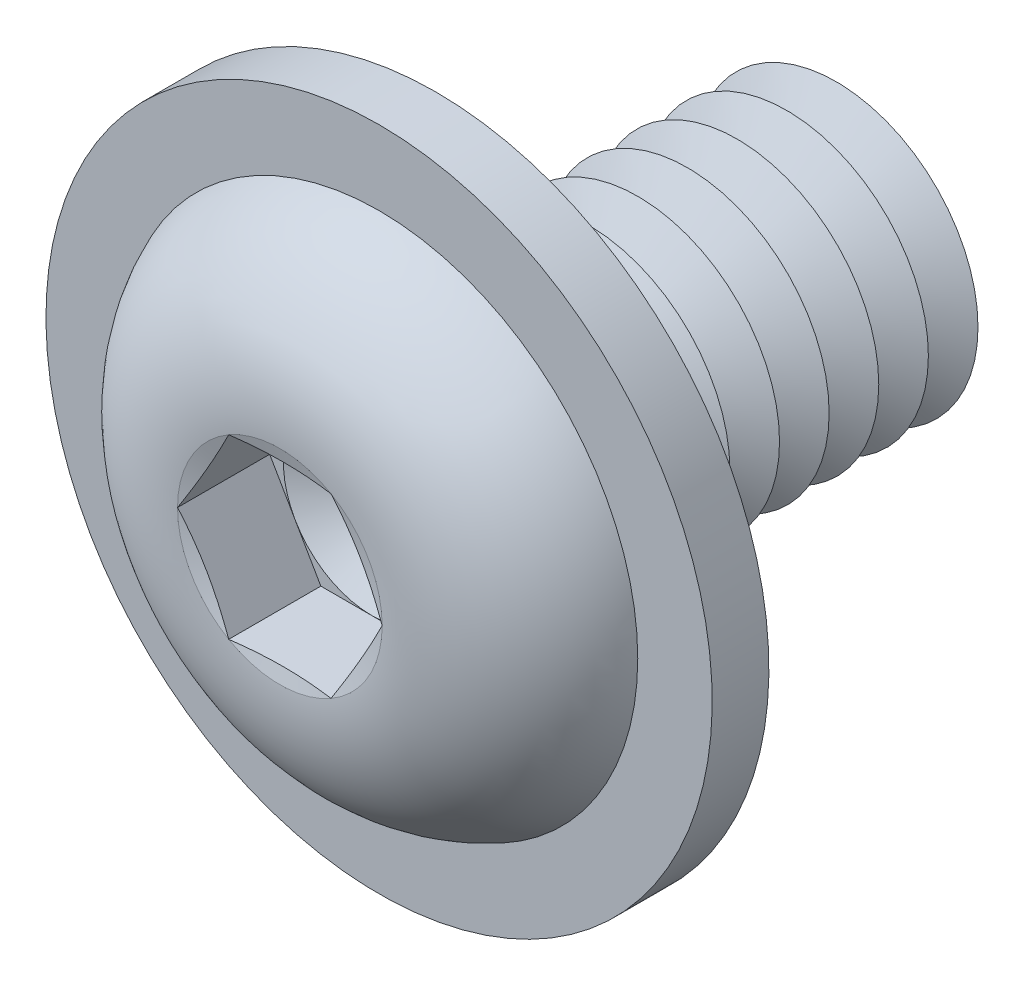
ISO-10303-21;
HEADER;
FILE_DESCRIPTION(('STEP AP214'),'2;1');
FILE_NAME('part.step','',(''),(''),'','','');
FILE_SCHEMA(('AUTOMOTIVE_DESIGN { 1 0 10303 214 1 1 1 1 }'));
ENDSEC;
DATA;
#1=APPLICATION_CONTEXT('core data for automotive mechanical design processes');
#2=APPLICATION_PROTOCOL_DEFINITION('international standard','automotive_design',2000,#1);
#3=PRODUCT_CONTEXT('',#1,'mechanical');
#4=PRODUCT('Part','Part','',(#3));
#5=PRODUCT_RELATED_PRODUCT_CATEGORY('part','',(#4));
#6=PRODUCT_DEFINITION_FORMATION('','',#4);
#7=PRODUCT_DEFINITION_CONTEXT('part definition',#1,'design');
#8=PRODUCT_DEFINITION('design','',#6,#7);
#9=PRODUCT_DEFINITION_SHAPE('','',#8);
#10=(LENGTH_UNIT() NAMED_UNIT(*) SI_UNIT(.MILLI.,.METRE.));
#11=(NAMED_UNIT(*) PLANE_ANGLE_UNIT() SI_UNIT($,.RADIAN.));
#12=(NAMED_UNIT(*) SI_UNIT($,.STERADIAN.) SOLID_ANGLE_UNIT());
#13=UNCERTAINTY_MEASURE_WITH_UNIT(LENGTH_MEASURE(1.E-05),#10,'distance_accuracy_value','');
#14=(GEOMETRIC_REPRESENTATION_CONTEXT(3) GLOBAL_UNCERTAINTY_ASSIGNED_CONTEXT((#13)) GLOBAL_UNIT_ASSIGNED_CONTEXT((#10,
#11,#12)) REPRESENTATION_CONTEXT('',''));
#15=CARTESIAN_POINT('',(0.,0.,0.));
#16=DIRECTION('',(0.,0.,1.));
#17=DIRECTION('',(1.,0.,0.));
#18=AXIS2_PLACEMENT_3D('',#15,#16,#17);
#19=CARTESIAN_POINT('',(0.,0.,-3.55));
#20=DIRECTION('',(0.,0.,1.));
#21=DIRECTION('',(1.,0.,0.));
#22=AXIS2_PLACEMENT_3D('',#19,#20,#21);
#23=CONICAL_SURFACE('',#22,2.,1.0471975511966);
#24=CARTESIAN_POINT('',(0.,0.,-3.9));
#25=DIRECTION('',(0.,0.,1.));
#26=DIRECTION('',(1.,0.,0.));
#27=AXIS2_PLACEMENT_3D('',#24,#25,#26);
#28=CIRCLE('',#27,1.39378221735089);
#29=CARTESIAN_POINT('',(1.39378221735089,0.,-3.9));
#30=VERTEX_POINT('',#29);
#31=EDGE_CURVE('E275',#30,#30,#28,.T.);
#32=ORIENTED_EDGE('',*,*,#31,.T.);
#33=EDGE_LOOP('',(#32));
#34=FACE_BOUND('',#33,.T.);
#35=CARTESIAN_POINT('',(0.,0.,-3.55));
#36=DIRECTION('',(0.,0.,1.));
#37=DIRECTION('',(1.,0.,0.));
#38=AXIS2_PLACEMENT_3D('',#35,#36,#37);
#39=CIRCLE('',#38,2.);
#40=CARTESIAN_POINT('',(2.,0.,-3.55));
#41=VERTEX_POINT('',#40);
#42=EDGE_CURVE('E271',#41,#41,#39,.T.);
#43=ORIENTED_EDGE('',*,*,#42,.F.);
#44=EDGE_LOOP('',(#43));
#45=FACE_BOUND('',#44,.T.);
#46=ADVANCED_FACE('F39',(#34,#45),#23,.T.);
#47=CARTESIAN_POINT('',(0.,0.,-3.9));
#48=DIRECTION('',(0.,0.,-1.));
#49=DIRECTION('',(-1.,0.,0.));
#50=AXIS2_PLACEMENT_3D('',#47,#48,#49);
#51=CONICAL_SURFACE('',#50,1.39378221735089,1.0471975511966);
#52=CARTESIAN_POINT('',(0.,0.,-4.25));
#53=DIRECTION('',(0.,0.,1.));
#54=DIRECTION('',(1.,0.,0.));
#55=AXIS2_PLACEMENT_3D('',#52,#53,#54);
#56=CIRCLE('',#55,2.);
#57=CARTESIAN_POINT('',(2.,0.,-4.25));
#58=VERTEX_POINT('',#57);
#59=EDGE_CURVE('E279',#58,#58,#56,.T.);
#60=ORIENTED_EDGE('',*,*,#59,.T.);
#61=EDGE_LOOP('',(#60));
#62=FACE_BOUND('',#61,.T.);
#63=ORIENTED_EDGE('',*,*,#31,.F.);
#64=EDGE_LOOP('',(#63));
#65=FACE_BOUND('',#64,.T.);
#66=ADVANCED_FACE('F422',(#62,#65),#51,.T.);
#67=CARTESIAN_POINT('',(0.,2.,-6.));
#68=DIRECTION('',(0.,0.,-1.));
#69=DIRECTION('',(-1.,0.,0.));
#70=AXIS2_PLACEMENT_3D('',#67,#68,#69);
#71=PLANE('',#70);
#72=CARTESIAN_POINT('',(0.,0.,-6.));
#73=DIRECTION('',(0.,0.,1.));
#74=DIRECTION('',(1.,0.,0.));
#75=AXIS2_PLACEMENT_3D('',#72,#73,#74);
#76=CIRCLE('',#75,1.39378221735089);
#77=CARTESIAN_POINT('',(1.39378221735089,0.,-6.));
#78=VERTEX_POINT('',#77);
#79=EDGE_CURVE('E298',#78,#78,#76,.T.);
#80=ORIENTED_EDGE('',*,*,#79,.F.);
#81=EDGE_LOOP('',(#80));
#82=FACE_BOUND('',#81,.T.);
#83=ADVANCED_FACE('F428',(#82),#71,.T.);
#84=CARTESIAN_POINT('',(0.,0.,-5.65));
#85=DIRECTION('',(0.,0.,1.));
#86=DIRECTION('',(1.,0.,0.));
#87=AXIS2_PLACEMENT_3D('',#84,#85,#86);
#88=CONICAL_SURFACE('',#87,2.,1.0471975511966);
#89=ORIENTED_EDGE('',*,*,#79,.T.);
#90=EDGE_LOOP('',(#89));
#91=FACE_BOUND('',#90,.T.);
#92=CARTESIAN_POINT('',(0.,0.,-5.65));
#93=DIRECTION('',(0.,0.,1.));
#94=DIRECTION('',(1.,0.,0.));
#95=AXIS2_PLACEMENT_3D('',#92,#93,#94);
#96=CIRCLE('',#95,2.);
#97=CARTESIAN_POINT('',(2.,0.,-5.65));
#98=VERTEX_POINT('',#97);
#99=EDGE_CURVE('E294',#98,#98,#96,.T.);
#100=ORIENTED_EDGE('',*,*,#99,.F.);
#101=EDGE_LOOP('',(#100));
#102=FACE_BOUND('',#101,.T.);
#103=ADVANCED_FACE('F447',(#91,#102),#88,.T.);
#104=CARTESIAN_POINT('',(0.,0.,-5.3));
#105=DIRECTION('',(0.,0.,-1.));
#106=DIRECTION('',(-1.,0.,0.));
#107=AXIS2_PLACEMENT_3D('',#104,#105,#106);
#108=CONICAL_SURFACE('',#107,1.39378221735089,1.0471975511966);
#109=ORIENTED_EDGE('',*,*,#99,.T.);
#110=EDGE_LOOP('',(#109));
#111=FACE_BOUND('',#110,.T.);
#112=CARTESIAN_POINT('',(0.,0.,-5.3));
#113=DIRECTION('',(0.,0.,1.));
#114=DIRECTION('',(1.,0.,0.));
#115=AXIS2_PLACEMENT_3D('',#112,#113,#114);
#116=CIRCLE('',#115,1.39378221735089);
#117=CARTESIAN_POINT('',(1.39378221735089,0.,-5.3));
#118=VERTEX_POINT('',#117);
#119=EDGE_CURVE('E291',#118,#118,#116,.T.);
#120=ORIENTED_EDGE('',*,*,#119,.F.);
#121=EDGE_LOOP('',(#120));
#122=FACE_BOUND('',#121,.T.);
#123=ADVANCED_FACE('F444',(#111,#122),#108,.T.);
#124=CARTESIAN_POINT('',(0.,0.,-4.95));
#125=DIRECTION('',(0.,0.,1.));
#126=DIRECTION('',(1.,0.,0.));
#127=AXIS2_PLACEMENT_3D('',#124,#125,#126);
#128=CONICAL_SURFACE('',#127,2.,1.0471975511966);
#129=ORIENTED_EDGE('',*,*,#119,.T.);
#130=EDGE_LOOP('',(#129));
#131=FACE_BOUND('',#130,.T.);
#132=CARTESIAN_POINT('',(0.,0.,-4.95));
#133=DIRECTION('',(0.,0.,1.));
#134=DIRECTION('',(1.,0.,0.));
#135=AXIS2_PLACEMENT_3D('',#132,#133,#134);
#136=CIRCLE('',#135,2.);
#137=CARTESIAN_POINT('',(2.,0.,-4.95));
#138=VERTEX_POINT('',#137);
#139=EDGE_CURVE('E287',#138,#138,#136,.T.);
#140=ORIENTED_EDGE('',*,*,#139,.F.);
#141=EDGE_LOOP('',(#140));
#142=FACE_BOUND('',#141,.T.);
#143=ADVANCED_FACE('F438',(#131,#142),#128,.T.);
#144=CARTESIAN_POINT('',(0.,0.,-4.6));
#145=DIRECTION('',(0.,0.,-1.));
#146=DIRECTION('',(-1.,0.,0.));
#147=AXIS2_PLACEMENT_3D('',#144,#145,#146);
#148=CONICAL_SURFACE('',#147,1.39378221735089,1.0471975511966);
#149=ORIENTED_EDGE('',*,*,#139,.T.);
#150=EDGE_LOOP('',(#149));
#151=FACE_BOUND('',#150,.T.);
#152=CARTESIAN_POINT('',(0.,0.,-4.6));
#153=DIRECTION('',(0.,0.,1.));
#154=DIRECTION('',(1.,0.,0.));
#155=AXIS2_PLACEMENT_3D('',#152,#153,#154);
#156=CIRCLE('',#155,1.39378221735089);
#157=CARTESIAN_POINT('',(1.39378221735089,0.,-4.6));
#158=VERTEX_POINT('',#157);
#159=EDGE_CURVE('E283',#158,#158,#156,.T.);
#160=ORIENTED_EDGE('',*,*,#159,.F.);
#161=EDGE_LOOP('',(#160));
#162=FACE_BOUND('',#161,.T.);
#163=ADVANCED_FACE('F434',(#151,#162),#148,.T.);
#164=CARTESIAN_POINT('',(0.,0.,-4.25));
#165=DIRECTION('',(0.,0.,1.));
#166=DIRECTION('',(1.,0.,0.));
#167=AXIS2_PLACEMENT_3D('',#164,#165,#166);
#168=CONICAL_SURFACE('',#167,2.,1.0471975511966);
#169=ORIENTED_EDGE('',*,*,#159,.T.);
#170=EDGE_LOOP('',(#169));
#171=FACE_BOUND('',#170,.T.);
#172=ORIENTED_EDGE('',*,*,#59,.F.);
#173=EDGE_LOOP('',(#172));
#174=FACE_BOUND('',#173,.T.);
#175=ADVANCED_FACE('F437',(#171,#174),#168,.T.);
#176=CARTESIAN_POINT('',(0.,0.,-2.85));
#177=DIRECTION('',(0.,0.,1.));
#178=DIRECTION('',(1.,0.,0.));
#179=AXIS2_PLACEMENT_3D('',#176,#177,#178);
#180=CONICAL_SURFACE('',#179,2.,1.0471975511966);
#181=CARTESIAN_POINT('',(0.,0.,-3.2));
#182=DIRECTION('',(0.,0.,1.));
#183=DIRECTION('',(1.,0.,0.));
#184=AXIS2_PLACEMENT_3D('',#181,#182,#183);
#185=CIRCLE('',#184,1.39378221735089);
#186=CARTESIAN_POINT('',(1.39378221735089,0.,-3.2));
#187=VERTEX_POINT('',#186);
#188=EDGE_CURVE('E267',#187,#187,#185,.T.);
#189=ORIENTED_EDGE('',*,*,#188,.T.);
#190=EDGE_LOOP('',(#189));
#191=FACE_BOUND('',#190,.T.);
#192=CARTESIAN_POINT('',(0.,0.,-2.85));
#193=DIRECTION('',(0.,0.,1.));
#194=DIRECTION('',(1.,0.,0.));
#195=AXIS2_PLACEMENT_3D('',#192,#193,#194);
#196=CIRCLE('',#195,2.);
#197=CARTESIAN_POINT('',(2.,0.,-2.85));
#198=VERTEX_POINT('',#197);
#199=EDGE_CURVE('E263',#198,#198,#196,.T.);
#200=ORIENTED_EDGE('',*,*,#199,.F.);
#201=EDGE_LOOP('',(#200));
#202=FACE_BOUND('',#201,.T.);
#203=ADVANCED_FACE('F442',(#191,#202),#180,.T.);
#204=CARTESIAN_POINT('',(0.,0.,-3.2));
#205=DIRECTION('',(0.,0.,-1.));
#206=DIRECTION('',(-1.,0.,0.));
#207=AXIS2_PLACEMENT_3D('',#204,#205,#206);
#208=CONICAL_SURFACE('',#207,1.39378221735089,1.0471975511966);
#209=ORIENTED_EDGE('',*,*,#42,.T.);
#210=EDGE_LOOP('',(#209));
#211=FACE_BOUND('',#210,.T.);
#212=ORIENTED_EDGE('',*,*,#188,.F.);
#213=EDGE_LOOP('',(#212));
#214=FACE_BOUND('',#213,.T.);
#215=ADVANCED_FACE('F493',(#211,#214),#208,.T.);
#216=CARTESIAN_POINT('',(0.,0.,-2.15));
#217=DIRECTION('',(0.,0.,1.));
#218=DIRECTION('',(1.,0.,0.));
#219=AXIS2_PLACEMENT_3D('',#216,#217,#218);
#220=CONICAL_SURFACE('',#219,2.,1.0471975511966);
#221=CARTESIAN_POINT('',(0.,0.,-2.5));
#222=DIRECTION('',(0.,0.,1.));
#223=DIRECTION('',(1.,0.,0.));
#224=AXIS2_PLACEMENT_3D('',#221,#222,#223);
#225=CIRCLE('',#224,1.39378221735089);
#226=CARTESIAN_POINT('',(1.39378221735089,0.,-2.5));
#227=VERTEX_POINT('',#226);
#228=EDGE_CURVE('E259',#227,#227,#225,.T.);
#229=ORIENTED_EDGE('',*,*,#228,.T.);
#230=EDGE_LOOP('',(#229));
#231=FACE_BOUND('',#230,.T.);
#232=CARTESIAN_POINT('',(0.,0.,-2.15));
#233=DIRECTION('',(0.,0.,1.));
#234=DIRECTION('',(1.,0.,0.));
#235=AXIS2_PLACEMENT_3D('',#232,#233,#234);
#236=CIRCLE('',#235,2.);
#237=CARTESIAN_POINT('',(2.,0.,-2.15));
#238=VERTEX_POINT('',#237);
#239=EDGE_CURVE('E255',#238,#238,#236,.T.);
#240=ORIENTED_EDGE('',*,*,#239,.F.);
#241=EDGE_LOOP('',(#240));
#242=FACE_BOUND('',#241,.T.);
#243=ADVANCED_FACE('F499',(#231,#242),#220,.T.);
#244=CARTESIAN_POINT('',(0.,0.,-2.5));
#245=DIRECTION('',(0.,0.,-1.));
#246=DIRECTION('',(-1.,0.,0.));
#247=AXIS2_PLACEMENT_3D('',#244,#245,#246);
#248=CONICAL_SURFACE('',#247,1.39378221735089,1.0471975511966);
#249=ORIENTED_EDGE('',*,*,#199,.T.);
#250=EDGE_LOOP('',(#249));
#251=FACE_BOUND('',#250,.T.);
#252=ORIENTED_EDGE('',*,*,#228,.F.);
#253=EDGE_LOOP('',(#252));
#254=FACE_BOUND('',#253,.T.);
#255=ADVANCED_FACE('F506',(#251,#254),#248,.T.);
#256=CARTESIAN_POINT('',(0.,0.,-1.45));
#257=DIRECTION('',(0.,0.,1.));
#258=DIRECTION('',(1.,0.,0.));
#259=AXIS2_PLACEMENT_3D('',#256,#257,#258);
#260=CONICAL_SURFACE('',#259,2.,1.0471975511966);
#261=CARTESIAN_POINT('',(0.,0.,-1.8));
#262=DIRECTION('',(0.,0.,1.));
#263=DIRECTION('',(1.,0.,0.));
#264=AXIS2_PLACEMENT_3D('',#261,#262,#263);
#265=CIRCLE('',#264,1.39378221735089);
#266=CARTESIAN_POINT('',(1.39378221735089,0.,-1.8));
#267=VERTEX_POINT('',#266);
#268=EDGE_CURVE('E251',#267,#267,#265,.T.);
#269=ORIENTED_EDGE('',*,*,#268,.T.);
#270=EDGE_LOOP('',(#269));
#271=FACE_BOUND('',#270,.T.);
#272=CARTESIAN_POINT('',(0.,0.,-1.45));
#273=DIRECTION('',(0.,0.,1.));
#274=DIRECTION('',(1.,0.,0.));
#275=AXIS2_PLACEMENT_3D('',#272,#273,#274);
#276=CIRCLE('',#275,2.);
#277=CARTESIAN_POINT('',(2.,0.,-1.45));
#278=VERTEX_POINT('',#277);
#279=EDGE_CURVE('E243',#278,#278,#276,.T.);
#280=ORIENTED_EDGE('',*,*,#279,.F.);
#281=EDGE_LOOP('',(#280));
#282=FACE_BOUND('',#281,.T.);
#283=ADVANCED_FACE('F513',(#271,#282),#260,.T.);
#284=CARTESIAN_POINT('',(0.,0.,-1.8));
#285=DIRECTION('',(0.,0.,-1.));
#286=DIRECTION('',(-1.,0.,0.));
#287=AXIS2_PLACEMENT_3D('',#284,#285,#286);
#288=CONICAL_SURFACE('',#287,1.39378221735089,1.0471975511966);
#289=ORIENTED_EDGE('',*,*,#239,.T.);
#290=EDGE_LOOP('',(#289));
#291=FACE_BOUND('',#290,.T.);
#292=ORIENTED_EDGE('',*,*,#268,.F.);
#293=EDGE_LOOP('',(#292));
#294=FACE_BOUND('',#293,.T.);
#295=ADVANCED_FACE('F520',(#291,#294),#288,.T.);
#296=CARTESIAN_POINT('',(0.,0.,-0.750000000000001));
#297=DIRECTION('',(0.,0.,1.));
#298=DIRECTION('',(1.,0.,0.));
#299=AXIS2_PLACEMENT_3D('',#296,#297,#298);
#300=CONICAL_SURFACE('',#299,2.,1.0471975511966);
#301=CARTESIAN_POINT('',(0.,0.,-1.1));
#302=DIRECTION('',(0.,0.,1.));
#303=DIRECTION('',(1.,0.,0.));
#304=AXIS2_PLACEMENT_3D('',#301,#302,#303);
#305=CIRCLE('',#304,1.39378221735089);
#306=CARTESIAN_POINT('',(1.39378221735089,0.,-1.1));
#307=VERTEX_POINT('',#306);
#308=EDGE_CURVE('E232',#307,#307,#305,.T.);
#309=ORIENTED_EDGE('',*,*,#308,.T.);
#310=EDGE_LOOP('',(#309));
#311=FACE_BOUND('',#310,.T.);
#312=CARTESIAN_POINT('',(0.,0.,-0.750000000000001));
#313=DIRECTION('',(0.,0.,1.));
#314=DIRECTION('',(1.,0.,0.));
#315=AXIS2_PLACEMENT_3D('',#312,#313,#314);
#316=CIRCLE('',#315,2.);
#317=CARTESIAN_POINT('',(2.,0.,-0.750000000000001));
#318=VERTEX_POINT('',#317);
#319=EDGE_CURVE('E247',#318,#318,#316,.T.);
#320=ORIENTED_EDGE('',*,*,#319,.F.);
#321=EDGE_LOOP('',(#320));
#322=FACE_BOUND('',#321,.T.);
#323=ADVANCED_FACE('F527',(#311,#322),#300,.T.);
#324=CARTESIAN_POINT('',(0.,0.,-1.1));
#325=DIRECTION('',(0.,0.,-1.));
#326=DIRECTION('',(-1.,0.,0.));
#327=AXIS2_PLACEMENT_3D('',#324,#325,#326);
#328=CONICAL_SURFACE('',#327,1.39378221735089,1.0471975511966);
#329=ORIENTED_EDGE('',*,*,#279,.T.);
#330=EDGE_LOOP('',(#329));
#331=FACE_BOUND('',#330,.T.);
#332=ORIENTED_EDGE('',*,*,#308,.F.);
#333=EDGE_LOOP('',(#332));
#334=FACE_BOUND('',#333,.T.);
#335=ADVANCED_FACE('F221',(#331,#334),#328,.T.);
#336=CARTESIAN_POINT('',(0.,2.,0.));
#337=DIRECTION('',(0.,0.,-1.));
#338=DIRECTION('',(-1.,0.,0.));
#339=AXIS2_PLACEMENT_3D('',#336,#337,#338);
#340=PLANE('',#339);
#341=CARTESIAN_POINT('',(0.,0.,0.));
#342=DIRECTION('',(0.,0.,-1.));
#343=DIRECTION('',(-1.,0.,0.));
#344=AXIS2_PLACEMENT_3D('',#341,#342,#343);
#345=CIRCLE('',#344,2.35);
#346=CARTESIAN_POINT('',(-2.35,0.,0.));
#347=VERTEX_POINT('',#346);
#348=EDGE_CURVE('E312',#347,#347,#345,.F.);
#349=ORIENTED_EDGE('',*,*,#348,.T.);
#350=EDGE_LOOP('',(#349));
#351=FACE_BOUND('',#350,.T.);
#352=CARTESIAN_POINT('',(0.,0.,0.));
#353=DIRECTION('',(0.,0.,-1.));
#354=DIRECTION('',(0.,1.,0.));
#355=AXIS2_PLACEMENT_3D('',#352,#353,#354);
#356=CIRCLE('',#355,4.7);
#357=CARTESIAN_POINT('',(0.,4.7,0.));
#358=VERTEX_POINT('',#357);
#359=EDGE_CURVE('E376',#358,#358,#356,.T.);
#360=ORIENTED_EDGE('',*,*,#359,.T.);
#361=EDGE_LOOP('',(#360));
#362=FACE_BOUND('',#361,.T.);
#363=ADVANCED_FACE('F539',(#351,#362),#340,.T.);
#364=CARTESIAN_POINT('',(0.,0.,-0.35));
#365=DIRECTION('',(0.,0.,-1.));
#366=DIRECTION('',(-1.,0.,0.));
#367=AXIS2_PLACEMENT_3D('',#364,#365,#366);
#368=TOROIDAL_SURFACE('',#367,2.35,0.35);
#369=ORIENTED_EDGE('',*,*,#348,.F.);
#370=EDGE_LOOP('',(#369));
#371=FACE_BOUND('',#370,.T.);
#372=CARTESIAN_POINT('',(0.,0.,-0.35));
#373=DIRECTION('',(0.,0.,-1.));
#374=DIRECTION('',(-1.,0.,0.));
#375=AXIS2_PLACEMENT_3D('',#372,#373,#374);
#376=CIRCLE('',#375,2.);
#377=CARTESIAN_POINT('',(-2.,0.,-0.35));
#378=VERTEX_POINT('',#377);
#379=EDGE_CURVE('E307',#378,#378,#376,.T.);
#380=ORIENTED_EDGE('',*,*,#379,.F.);
#381=EDGE_LOOP('',(#380));
#382=FACE_BOUND('',#381,.T.);
#383=ADVANCED_FACE('F41',(#371,#382),#368,.F.);
#384=CARTESIAN_POINT('',(0.,0.,-6.));
#385=DIRECTION('',(0.,0.,-1.));
#386=DIRECTION('',(-1.,0.,0.));
#387=AXIS2_PLACEMENT_3D('',#384,#385,#386);
#388=CYLINDRICAL_SURFACE('',#387,2.);
#389=ORIENTED_EDGE('',*,*,#379,.T.);
#390=EDGE_LOOP('',(#389));
#391=FACE_BOUND('',#390,.T.);
#392=ORIENTED_EDGE('',*,*,#319,.T.);
#393=EDGE_LOOP('',(#392));
#394=FACE_BOUND('',#393,.T.);
#395=ADVANCED_FACE('F551',(#391,#394),#388,.T.);
#396=CARTESIAN_POINT('',(0.,0.,0.8));
#397=DIRECTION('',(0.,0.,-1.));
#398=DIRECTION('',(0.,1.,0.));
#399=AXIS2_PLACEMENT_3D('',#396,#397,#398);
#400=CYLINDRICAL_SURFACE('',#399,4.7);
#401=CARTESIAN_POINT('',(0.,0.,0.8));
#402=DIRECTION('',(0.,0.,-1.));
#403=DIRECTION('',(0.,1.,0.));
#404=AXIS2_PLACEMENT_3D('',#401,#402,#403);
#405=CIRCLE('',#404,4.7);
#406=CARTESIAN_POINT('',(0.,4.7,0.8));
#407=VERTEX_POINT('',#406);
#408=EDGE_CURVE('E374',#407,#407,#405,.T.);
#409=ORIENTED_EDGE('',*,*,#408,.T.);
#410=EDGE_LOOP('',(#409));
#411=FACE_BOUND('',#410,.T.);
#412=ORIENTED_EDGE('',*,*,#359,.F.);
#413=EDGE_LOOP('',(#412));
#414=FACE_BOUND('',#413,.T.);
#415=ADVANCED_FACE('F557',(#411,#414),#400,.T.);
#416=CARTESIAN_POINT('',(0.,0.,0.8));
#417=DIRECTION('',(0.,0.,-1.));
#418=DIRECTION('',(0.,1.,0.));
#419=AXIS2_PLACEMENT_3D('',#416,#417,#418);
#420=PLANE('',#419);
#421=CARTESIAN_POINT('',(0.,0.,0.8));
#422=DIRECTION('',(0.,0.,-1.));
#423=DIRECTION('',(0.,1.,0.));
#424=AXIS2_PLACEMENT_3D('',#421,#422,#423);
#425=CIRCLE('',#424,3.64977164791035);
#426=CARTESIAN_POINT('',(0.,3.64977164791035,0.8));
#427=VERTEX_POINT('',#426);
#428=EDGE_CURVE('E43',#427,#427,#425,.F.);
#429=ORIENTED_EDGE('',*,*,#428,.F.);
#430=EDGE_LOOP('',(#429));
#431=FACE_BOUND('',#430,.T.);
#432=ORIENTED_EDGE('',*,*,#408,.F.);
#433=EDGE_LOOP('',(#432));
#434=FACE_BOUND('',#433,.T.);
#435=ADVANCED_FACE('F117',(#431,#434),#420,.F.);
#436=CARTESIAN_POINT('',(0.,0.,0.9));
#437=DIRECTION('',(0.,0.,1.));
#438=DIRECTION('',(1.,0.,0.));
#439=AXIS2_PLACEMENT_3D('',#436,#437,#438);
#440=CONICAL_SURFACE('',#439,1.24999941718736,1.0471975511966);
#441=CARTESIAN_POINT('',(0.,0.,0.178312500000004));
#442=VERTEX_POINT('',#441);
#443=VERTEX_LOOP('',#442);
#444=FACE_BOUND('',#443,.T.);
#445=CARTESIAN_POINT('',(0.,0.,0.9));
#446=DIRECTION('',(0.,0.,1.));
#447=DIRECTION('',(1.,0.,0.));
#448=AXIS2_PLACEMENT_3D('',#445,#446,#447);
#449=CIRCLE('',#448,1.24999941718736);
#450=CARTESIAN_POINT('',(1.08253125,0.624999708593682,0.9));
#451=VERTEX_POINT('',#450);
#452=CARTESIAN_POINT('',(0.,1.24999941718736,0.9));
#453=VERTEX_POINT('',#452);
#454=EDGE_CURVE('E120',#451,#453,#449,.T.);
#455=ORIENTED_EDGE('',*,*,#454,.T.);
#456=CARTESIAN_POINT('',(0.,0.,0.9));
#457=DIRECTION('',(0.,0.,1.));
#458=DIRECTION('',(1.,0.,0.));
#459=AXIS2_PLACEMENT_3D('',#456,#457,#458);
#460=CIRCLE('',#459,1.24999941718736);
#461=CARTESIAN_POINT('',(-1.08253125,0.624999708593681,0.9));
#462=VERTEX_POINT('',#461);
#463=EDGE_CURVE('E11',#453,#462,#460,.T.);
#464=ORIENTED_EDGE('',*,*,#463,.T.);
#465=CARTESIAN_POINT('',(-1.08253125,-0.624999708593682,0.9));
#466=VERTEX_POINT('',#465);
#467=EDGE_CURVE('E49',#462,#466,#460,.T.);
#468=ORIENTED_EDGE('',*,*,#467,.T.);
#469=CARTESIAN_POINT('',(0.,-1.24999941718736,0.9));
#470=VERTEX_POINT('',#469);
#471=EDGE_CURVE('E319',#466,#470,#460,.T.);
#472=ORIENTED_EDGE('',*,*,#471,.T.);
#473=CARTESIAN_POINT('',(1.08253125,-0.624999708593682,0.9));
#474=VERTEX_POINT('',#473);
#475=EDGE_CURVE('E57',#470,#474,#460,.T.);
#476=ORIENTED_EDGE('',*,*,#475,.T.);
#477=EDGE_CURVE('E50',#474,#451,#460,.T.);
#478=ORIENTED_EDGE('',*,*,#477,.T.);
#479=EDGE_LOOP('',(#455,#464,#468,#472,#476,#478));
#480=FACE_BOUND('',#479,.T.);
#481=ADVANCED_FACE('F114',(#444,#480),#440,.F.);
#482=CARTESIAN_POINT('',(0.,0.,0.9));
#483=DIRECTION('',(0.,0.,1.));
#484=DIRECTION('',(1.,0.,0.));
#485=AXIS2_PLACEMENT_3D('',#482,#483,#484);
#486=PLANE('',#485);
#487=ORIENTED_EDGE('',*,*,#471,.F.);
#488=DIRECTION('',(0.5,-0.866025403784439,0.));
#489=VECTOR('',#488,1.);
#490=CARTESIAN_POINT('',(-1.443375,0.,0.9));
#491=LINE('',#490,#489);
#492=CARTESIAN_POINT('',(-0.7216875,-1.24999941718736,0.9));
#493=VERTEX_POINT('',#492);
#494=EDGE_CURVE('E154',#466,#493,#491,.T.);
#495=ORIENTED_EDGE('',*,*,#494,.T.);
#496=DIRECTION('',(1.,0.,0.));
#497=VECTOR('',#496,1.);
#498=CARTESIAN_POINT('',(-0.7216875,-1.24999941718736,0.9));
#499=LINE('',#498,#497);
#500=EDGE_CURVE('E160',#493,#470,#499,.T.);
#501=ORIENTED_EDGE('',*,*,#500,.T.);
#502=EDGE_LOOP('',(#487,#495,#501));
#503=FACE_BOUND('',#502,.T.);
#504=ADVANCED_FACE('F116',(#503),#486,.T.);
#505=ORIENTED_EDGE('',*,*,#475,.F.);
#506=CARTESIAN_POINT('',(0.721687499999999,-1.24999941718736,0.9));
#507=VERTEX_POINT('',#506);
#508=EDGE_CURVE('E159',#470,#507,#499,.T.);
#509=ORIENTED_EDGE('',*,*,#508,.T.);
#510=DIRECTION('',(0.5,0.866025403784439,0.));
#511=VECTOR('',#510,1.);
#512=CARTESIAN_POINT('',(0.721687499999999,-1.24999941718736,0.9));
#513=LINE('',#512,#511);
#514=EDGE_CURVE('E165',#507,#474,#513,.T.);
#515=ORIENTED_EDGE('',*,*,#514,.T.);
#516=EDGE_LOOP('',(#505,#509,#515));
#517=FACE_BOUND('',#516,.T.);
#518=ADVANCED_FACE('F382',(#517),#486,.T.);
#519=ORIENTED_EDGE('',*,*,#477,.F.);
#520=CARTESIAN_POINT('',(1.443375,0.,0.9));
#521=VERTEX_POINT('',#520);
#522=EDGE_CURVE('E164',#474,#521,#513,.T.);
#523=ORIENTED_EDGE('',*,*,#522,.T.);
#524=DIRECTION('',(-0.5,0.866025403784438,0.));
#525=VECTOR('',#524,1.);
#526=CARTESIAN_POINT('',(1.443375,0.,0.9));
#527=LINE('',#526,#525);
#528=EDGE_CURVE('E142',#521,#451,#527,.T.);
#529=ORIENTED_EDGE('',*,*,#528,.T.);
#530=EDGE_LOOP('',(#519,#523,#529));
#531=FACE_BOUND('',#530,.T.);
#532=ADVANCED_FACE('F395',(#531),#486,.T.);
#533=ORIENTED_EDGE('',*,*,#454,.F.);
#534=CARTESIAN_POINT('',(0.7216875,1.24999941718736,0.9));
#535=VERTEX_POINT('',#534);
#536=EDGE_CURVE('E127',#451,#535,#527,.T.);
#537=ORIENTED_EDGE('',*,*,#536,.T.);
#538=DIRECTION('',(-1.,0.,0.));
#539=VECTOR('',#538,1.);
#540=CARTESIAN_POINT('',(0.7216875,1.24999941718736,0.9));
#541=LINE('',#540,#539);
#542=EDGE_CURVE('E138',#535,#453,#541,.T.);
#543=ORIENTED_EDGE('',*,*,#542,.T.);
#544=EDGE_LOOP('',(#533,#537,#543));
#545=FACE_BOUND('',#544,.T.);
#546=ADVANCED_FACE('F144',(#545),#486,.T.);
#547=ORIENTED_EDGE('',*,*,#463,.F.);
#548=CARTESIAN_POINT('',(-0.721687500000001,1.24999941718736,0.9));
#549=VERTEX_POINT('',#548);
#550=EDGE_CURVE('E133',#453,#549,#541,.T.);
#551=ORIENTED_EDGE('',*,*,#550,.T.);
#552=DIRECTION('',(-0.5,-0.866025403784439,0.));
#553=VECTOR('',#552,1.);
#554=CARTESIAN_POINT('',(-0.721687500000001,1.24999941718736,0.9));
#555=LINE('',#554,#553);
#556=EDGE_CURVE('E136',#549,#462,#555,.T.);
#557=ORIENTED_EDGE('',*,*,#556,.T.);
#558=EDGE_LOOP('',(#547,#551,#557));
#559=FACE_BOUND('',#558,.T.);
#560=ADVANCED_FACE('F132',(#559),#486,.T.);
#561=ORIENTED_EDGE('',*,*,#467,.F.);
#562=CARTESIAN_POINT('',(-1.443375,0.,0.9));
#563=VERTEX_POINT('',#562);
#564=EDGE_CURVE('E146',#462,#563,#555,.T.);
#565=ORIENTED_EDGE('',*,*,#564,.T.);
#566=EDGE_CURVE('E155',#563,#466,#491,.T.);
#567=ORIENTED_EDGE('',*,*,#566,.T.);
#568=EDGE_LOOP('',(#561,#565,#567));
#569=FACE_BOUND('',#568,.T.);
#570=ADVANCED_FACE('F335',(#569),#486,.T.);
#571=CARTESIAN_POINT('',(-1.443375,0.,0.9));
#572=DIRECTION('',(-0.866025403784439,-0.5,0.));
#573=DIRECTION('',(0.5,-0.866025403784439,0.));
#574=AXIS2_PLACEMENT_3D('',#571,#572,#573);
#575=PLANE('',#574);
#576=CARTESIAN_POINT('',(-1.44349047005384,0.000200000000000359,2.20003094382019));
#577=CARTESIAN_POINT('',(-1.41351104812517,-0.0517258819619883,2.19199301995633));
#578=CARTESIAN_POINT('',(-1.38347725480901,-0.10374593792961,2.18469579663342));
#579=CARTESIAN_POINT('',(-1.32330355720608,-0.20796983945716,2.17187512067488));
#580=CARTESIAN_POINT('',(-1.29316361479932,-0.260173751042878,2.16635238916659));
#581=CARTESIAN_POINT('',(-1.23296043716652,-0.364448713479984,2.15740323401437));
#582=CARTESIAN_POINT('',(-1.20289760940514,-0.416519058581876,2.15396613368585));
#583=CARTESIAN_POINT('',(-1.14273359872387,-0.520726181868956,2.14935732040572));
#584=CARTESIAN_POINT('',(-1.11263242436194,-0.572862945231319,2.14818516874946));
#585=CARTESIAN_POINT('',(-1.05243007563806,-0.677136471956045,2.14818516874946));
#586=CARTESIAN_POINT('',(-1.02232890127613,-0.729273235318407,2.14935732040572));
#587=CARTESIAN_POINT('',(-0.962164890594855,-0.833480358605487,2.15396613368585));
#588=CARTESIAN_POINT('',(-0.932102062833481,-0.885550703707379,2.15740323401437));
#589=CARTESIAN_POINT('',(-0.87189888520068,-0.989825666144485,2.16635238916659));
#590=CARTESIAN_POINT('',(-0.841758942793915,-1.0420295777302,2.17187512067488));
#591=CARTESIAN_POINT('',(-0.78158524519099,-1.14625347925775,2.18469579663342));
#592=CARTESIAN_POINT('',(-0.751551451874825,-1.19827353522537,2.19199301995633));
#593=CARTESIAN_POINT('',(-0.721572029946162,-1.25019941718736,2.20003094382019));
#594=B_SPLINE_CURVE_WITH_KNOTS('',3,(#576,#577,#578,#579,#580,#581,#582,#583,#584,#585,#586,
#587,#588,#589,#590,#591,#592,#593),.UNSPECIFIED.,.F.,.F.,(4,2,2,2,2,2,2,2,4),(0.,
0.181495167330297,0.363063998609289,0.543695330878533,0.724291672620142,0.904888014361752,
1.08551934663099,1.26708817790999,1.44858334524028),.UNSPECIFIED.);
#595=CARTESIAN_POINT('',(-1.443375,0.,2.2));
#596=VERTEX_POINT('',#595);
#597=CARTESIAN_POINT('',(-0.7216875,-1.24999941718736,2.2));
#598=VERTEX_POINT('',#597);
#599=EDGE_CURVE('E340',#596,#598,#594,.T.);
#600=ORIENTED_EDGE('',*,*,#599,.T.);
#601=DIRECTION('',(0.,0.,1.));
#602=VECTOR('',#601,1.);
#603=CARTESIAN_POINT('',(-0.7216875,-1.24999941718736,0.9));
#604=LINE('',#603,#602);
#605=EDGE_CURVE('E178',#493,#598,#604,.T.);
#606=ORIENTED_EDGE('',*,*,#605,.F.);
#607=ORIENTED_EDGE('',*,*,#494,.F.);
#608=ORIENTED_EDGE('',*,*,#566,.F.);
#609=DIRECTION('',(0.,0.,1.));
#610=VECTOR('',#609,1.);
#611=CARTESIAN_POINT('',(-1.443375,0.,0.9));
#612=LINE('',#611,#610);
#613=EDGE_CURVE('E182',#563,#596,#612,.T.);
#614=ORIENTED_EDGE('',*,*,#613,.T.);
#615=EDGE_LOOP('',(#600,#606,#607,#608,#614));
#616=FACE_BOUND('',#615,.T.);
#617=ADVANCED_FACE('F333',(#616),#575,.F.);
#618=CARTESIAN_POINT('',(-0.7216875,-1.24999941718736,0.9));
#619=DIRECTION('',(0.,-1.,0.));
#620=DIRECTION('',(0.,0.,-1.));
#621=AXIS2_PLACEMENT_3D('',#618,#619,#620);
#622=PLANE('',#621);
#623=CARTESIAN_POINT('',(-2.17815859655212,-1.24999941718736,2.48616275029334));
#624=CARTESIAN_POINT('',(-2.07269794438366,-1.24999941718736,2.4616881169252));
#625=CARTESIAN_POINT('',(-1.96714913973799,-1.24999941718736,2.43756889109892));
#626=CARTESIAN_POINT('',(-1.75576352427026,-1.24999941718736,2.39052699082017));
#627=CARTESIAN_POINT('',(-1.64992665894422,-1.24999941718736,2.36760456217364));
#628=CARTESIAN_POINT('',(-1.43690237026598,-1.24999941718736,2.3232454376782));
#629=CARTESIAN_POINT('',(-1.32971158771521,-1.24999941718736,2.30182468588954));
#630=CARTESIAN_POINT('',(-1.1148274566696,-1.24999941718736,2.26156703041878));
#631=CARTESIAN_POINT('',(-1.00713406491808,-1.24999941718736,2.24273035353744));
#632=CARTESIAN_POINT('',(-0.794044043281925,-1.24999941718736,2.2093913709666));
#633=CARTESIAN_POINT('',(-0.688664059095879,-1.24999941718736,2.19478562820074));
#634=CARTESIAN_POINT('',(-0.477310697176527,-1.24999941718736,2.17085809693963));
#635=CARTESIAN_POINT('',(-0.371337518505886,-1.24999941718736,2.16153463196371));
#636=CARTESIAN_POINT('',(-0.159455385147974,-1.24999941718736,2.14976770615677));
#637=CARTESIAN_POINT('',(-0.0535482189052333,-1.24999941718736,2.14729400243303));
#638=CARTESIAN_POINT('',(0.158189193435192,-1.24999941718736,2.14966287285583));
#639=CARTESIAN_POINT('',(0.264019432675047,-1.24999941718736,2.15450603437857));
#640=CARTESIAN_POINT('',(0.445148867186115,-1.24999941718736,2.16825380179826));
#641=CARTESIAN_POINT('',(0.520574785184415,-1.24999941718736,2.17561242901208));
#642=CARTESIAN_POINT('',(0.671115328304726,-1.24999941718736,2.19297000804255));
#643=CARTESIAN_POINT('',(0.746229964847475,-1.24999941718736,2.20296886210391));
#644=CARTESIAN_POINT('',(0.896387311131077,-1.24999941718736,2.22505910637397));
#645=CARTESIAN_POINT('',(0.971429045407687,-1.24999941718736,2.23715700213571));
#646=CARTESIAN_POINT('',(1.12124320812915,-1.24999941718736,2.26292371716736));
#647=CARTESIAN_POINT('',(1.19601562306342,-1.24999941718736,2.27659261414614));
#648=CARTESIAN_POINT('',(1.34686913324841,-1.24999941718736,2.30540811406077));
#649=CARTESIAN_POINT('',(1.42294548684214,-1.24999941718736,2.32057934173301));
#650=CARTESIAN_POINT('',(1.57490676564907,-1.24999941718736,2.351851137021));
#651=CARTESIAN_POINT('',(1.65079168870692,-1.24999941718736,2.36795171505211));
#652=CARTESIAN_POINT('',(1.80199501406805,-1.24999941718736,2.40076814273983));
#653=CARTESIAN_POINT('',(1.87731425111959,-1.24999941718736,2.41748016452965));
#654=CARTESIAN_POINT('',(2.02782424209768,-1.24999941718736,2.45144971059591));
#655=CARTESIAN_POINT('',(2.10301500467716,-1.24999941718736,2.46870719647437));
#656=CARTESIAN_POINT('',(2.17815859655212,-1.24999941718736,2.48616275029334));
#657=B_SPLINE_CURVE_WITH_KNOTS('',3,(#623,#624,#625,#626,#627,#628,#629,#630,#631,#632,#633,
#634,#635,#636,#637,#638,#639,#640,#641,#642,#643,#644,#645,#646,#647,#648,#649,#650,#651,#652,
#653,#654,#655,#656),.UNSPECIFIED.,.F.,.F.,(4,2,2,2,2,2,2,2,2,2,2,2,2,2,2,2,4),(0.,
0.324797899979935,0.649662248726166,0.977572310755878,1.30551113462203,1.62458166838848,
1.94355087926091,2.26110952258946,2.57869365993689,2.80599541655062,3.03328875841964,
3.26129956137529,3.48932164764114,3.7220371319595,3.95475522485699,4.18620606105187,
4.41764064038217),.UNSPECIFIED.);
#658=CARTESIAN_POINT('',(0.721687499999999,-1.24999941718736,2.2));
#659=VERTEX_POINT('',#658);
#660=EDGE_CURVE('E346',#598,#659,#657,.T.);
#661=ORIENTED_EDGE('',*,*,#660,.T.);
#662=DIRECTION('',(0.,0.,1.));
#663=VECTOR('',#662,1.);
#664=CARTESIAN_POINT('',(0.721687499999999,-1.24999941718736,0.9));
#665=LINE('',#664,#663);
#666=EDGE_CURVE('E174',#507,#659,#665,.T.);
#667=ORIENTED_EDGE('',*,*,#666,.F.);
#668=ORIENTED_EDGE('',*,*,#508,.F.);
#669=ORIENTED_EDGE('',*,*,#500,.F.);
#670=ORIENTED_EDGE('',*,*,#605,.T.);
#671=EDGE_LOOP('',(#661,#667,#668,#669,#670));
#672=FACE_BOUND('',#671,.T.);
#673=ADVANCED_FACE('F385',(#672),#622,.F.);
#674=CARTESIAN_POINT('',(0.721687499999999,-1.24999941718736,0.9));
#675=DIRECTION('',(0.866025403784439,-0.5,0.));
#676=DIRECTION('',(0.5,0.866025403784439,0.));
#677=AXIS2_PLACEMENT_3D('',#674,#675,#676);
#678=PLANE('',#677);
#679=CARTESIAN_POINT('',(0.721572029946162,-1.25019941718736,2.20003094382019));
#680=CARTESIAN_POINT('',(0.751551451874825,-1.19827353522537,2.19199301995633));
#681=CARTESIAN_POINT('',(0.78158524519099,-1.14625347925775,2.18469579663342));
#682=CARTESIAN_POINT('',(0.841758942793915,-1.0420295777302,2.17187512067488));
#683=CARTESIAN_POINT('',(0.87189888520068,-0.989825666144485,2.16635238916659));
#684=CARTESIAN_POINT('',(0.932102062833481,-0.885550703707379,2.15740323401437));
#685=CARTESIAN_POINT('',(0.962164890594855,-0.833480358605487,2.15396613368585));
#686=CARTESIAN_POINT('',(1.02232890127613,-0.729273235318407,2.14935732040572));
#687=CARTESIAN_POINT('',(1.05243007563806,-0.677136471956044,2.14818516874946));
#688=CARTESIAN_POINT('',(1.11263242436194,-0.572862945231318,2.14818516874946));
#689=CARTESIAN_POINT('',(1.14273359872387,-0.520726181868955,2.14935732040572));
#690=CARTESIAN_POINT('',(1.20289760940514,-0.416519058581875,2.15396613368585));
#691=CARTESIAN_POINT('',(1.23296043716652,-0.364448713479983,2.15740323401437));
#692=CARTESIAN_POINT('',(1.29316361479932,-0.260173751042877,2.16635238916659));
#693=CARTESIAN_POINT('',(1.32330355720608,-0.20796983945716,2.17187512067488));
#694=CARTESIAN_POINT('',(1.38347725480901,-0.103745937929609,2.18469579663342));
#695=CARTESIAN_POINT('',(1.41351104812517,-0.0517258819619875,2.19199301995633));
#696=CARTESIAN_POINT('',(1.44349047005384,0.000200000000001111,2.20003094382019));
#697=B_SPLINE_CURVE_WITH_KNOTS('',3,(#679,#680,#681,#682,#683,#684,#685,#686,#687,#688,#689,
#690,#691,#692,#693,#694,#695,#696),.UNSPECIFIED.,.F.,.F.,(4,2,2,2,2,2,2,2,4),(0.,
0.181495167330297,0.36306399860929,0.543695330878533,0.724291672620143,0.904888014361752,
1.085519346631,1.26708817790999,1.44858334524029),.UNSPECIFIED.);
#698=CARTESIAN_POINT('',(1.443375,0.,2.2));
#699=VERTEX_POINT('',#698);
#700=EDGE_CURVE('E233',#659,#699,#697,.T.);
#701=ORIENTED_EDGE('',*,*,#700,.T.);
#702=DIRECTION('',(0.,0.,1.));
#703=VECTOR('',#702,1.);
#704=CARTESIAN_POINT('',(1.443375,0.,0.9));
#705=LINE('',#704,#703);
#706=EDGE_CURVE('E169',#521,#699,#705,.T.);
#707=ORIENTED_EDGE('',*,*,#706,.F.);
#708=ORIENTED_EDGE('',*,*,#522,.F.);
#709=ORIENTED_EDGE('',*,*,#514,.F.);
#710=ORIENTED_EDGE('',*,*,#666,.T.);
#711=EDGE_LOOP('',(#701,#707,#708,#709,#710));
#712=FACE_BOUND('',#711,.T.);
#713=ADVANCED_FACE('F219',(#712),#678,.F.);
#714=CARTESIAN_POINT('',(1.443375,0.,0.9));
#715=DIRECTION('',(0.866025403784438,0.5,0.));
#716=DIRECTION('',(-0.5,0.866025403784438,0.));
#717=AXIS2_PLACEMENT_3D('',#714,#715,#716);
#718=PLANE('',#717);
#719=CARTESIAN_POINT('',(1.44349047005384,-0.000199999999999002,2.20003094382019));
#720=CARTESIAN_POINT('',(1.41351104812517,0.0517258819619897,2.19199301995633));
#721=CARTESIAN_POINT('',(1.38347725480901,0.103745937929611,2.18469579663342));
#722=CARTESIAN_POINT('',(1.32330355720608,0.207969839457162,2.17187512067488));
#723=CARTESIAN_POINT('',(1.29316361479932,0.260173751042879,2.16635238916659));
#724=CARTESIAN_POINT('',(1.23296043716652,0.364448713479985,2.15740323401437));
#725=CARTESIAN_POINT('',(1.20289760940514,0.416519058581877,2.15396613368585));
#726=CARTESIAN_POINT('',(1.14273359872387,0.520726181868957,2.14935732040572));
#727=CARTESIAN_POINT('',(1.11263242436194,0.572862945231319,2.14818516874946));
#728=CARTESIAN_POINT('',(1.05243007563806,0.677136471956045,2.14818516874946));
#729=CARTESIAN_POINT('',(1.02232890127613,0.729273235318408,2.14935732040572));
#730=CARTESIAN_POINT('',(0.962164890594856,0.833480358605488,2.15396613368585));
#731=CARTESIAN_POINT('',(0.932102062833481,0.88555070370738,2.15740323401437));
#732=CARTESIAN_POINT('',(0.87189888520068,0.989825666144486,2.16635238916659));
#733=CARTESIAN_POINT('',(0.841758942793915,1.0420295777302,2.17187512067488));
#734=CARTESIAN_POINT('',(0.781585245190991,1.14625347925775,2.18469579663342));
#735=CARTESIAN_POINT('',(0.751551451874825,1.19827353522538,2.19199301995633));
#736=CARTESIAN_POINT('',(0.721572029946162,1.25019941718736,2.20003094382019));
#737=B_SPLINE_CURVE_WITH_KNOTS('',3,(#719,#720,#721,#722,#723,#724,#725,#726,#727,#728,#729,
#730,#731,#732,#733,#734,#735,#736),.UNSPECIFIED.,.F.,.F.,(4,2,2,2,2,2,2,2,4),(0.,
0.181495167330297,0.363063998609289,0.543695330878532,0.724291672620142,0.904888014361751,
1.08551934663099,1.26708817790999,1.44858334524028),.UNSPECIFIED.);
#738=CARTESIAN_POINT('',(0.721687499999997,1.24999941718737,2.2));
#739=VERTEX_POINT('',#738);
#740=EDGE_CURVE('E224',#699,#739,#737,.T.);
#741=ORIENTED_EDGE('',*,*,#740,.T.);
#742=DIRECTION('',(0.,0.,1.));
#743=VECTOR('',#742,1.);
#744=CARTESIAN_POINT('',(0.7216875,1.24999941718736,0.9));
#745=LINE('',#744,#743);
#746=EDGE_CURVE('E65',#535,#739,#745,.T.);
#747=ORIENTED_EDGE('',*,*,#746,.F.);
#748=ORIENTED_EDGE('',*,*,#536,.F.);
#749=ORIENTED_EDGE('',*,*,#528,.F.);
#750=ORIENTED_EDGE('',*,*,#706,.T.);
#751=EDGE_LOOP('',(#741,#747,#748,#749,#750));
#752=FACE_BOUND('',#751,.T.);
#753=ADVANCED_FACE('F213',(#752),#718,.F.);
#754=CARTESIAN_POINT('',(0.7216875,1.24999941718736,0.9));
#755=DIRECTION('',(0.,1.,0.));
#756=DIRECTION('',(-1.,0.,0.));
#757=AXIS2_PLACEMENT_3D('',#754,#755,#756);
#758=PLANE('',#757);
#759=CARTESIAN_POINT('',(2.17815859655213,1.24999941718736,2.48616275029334));
#760=CARTESIAN_POINT('',(2.07269794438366,1.24999941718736,2.4616881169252));
#761=CARTESIAN_POINT('',(1.96714913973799,1.24999941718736,2.43756889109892));
#762=CARTESIAN_POINT('',(1.75576352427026,1.24999941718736,2.39052699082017));
#763=CARTESIAN_POINT('',(1.64992665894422,1.24999941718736,2.36760456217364));
#764=CARTESIAN_POINT('',(1.43690237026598,1.24999941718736,2.3232454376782));
#765=CARTESIAN_POINT('',(1.32971158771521,1.24999941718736,2.30182468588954));
#766=CARTESIAN_POINT('',(1.1148274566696,1.24999941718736,2.26156703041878));
#767=CARTESIAN_POINT('',(1.00713406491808,1.24999941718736,2.24273035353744));
#768=CARTESIAN_POINT('',(0.794044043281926,1.24999941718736,2.2093913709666));
#769=CARTESIAN_POINT('',(0.688664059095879,1.24999941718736,2.19478562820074));
#770=CARTESIAN_POINT('',(0.477310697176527,1.24999941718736,2.17085809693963));
#771=CARTESIAN_POINT('',(0.371337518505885,1.24999941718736,2.16153463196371));
#772=CARTESIAN_POINT('',(0.159455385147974,1.24999941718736,2.14976770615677));
#773=CARTESIAN_POINT('',(0.053548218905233,1.24999941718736,2.14729400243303));
#774=CARTESIAN_POINT('',(-0.158189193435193,1.24999941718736,2.14966287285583));
#775=CARTESIAN_POINT('',(-0.264019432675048,1.24999941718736,2.15450603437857));
#776=CARTESIAN_POINT('',(-0.445148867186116,1.24999941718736,2.16825380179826));
#777=CARTESIAN_POINT('',(-0.520574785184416,1.24999941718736,2.17561242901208));
#778=CARTESIAN_POINT('',(-0.671115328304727,1.24999941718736,2.19297000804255));
#779=CARTESIAN_POINT('',(-0.746229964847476,1.24999941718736,2.20296886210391));
#780=CARTESIAN_POINT('',(-0.896387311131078,1.24999941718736,2.22505910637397));
#781=CARTESIAN_POINT('',(-0.971429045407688,1.24999941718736,2.23715700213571));
#782=CARTESIAN_POINT('',(-1.12124320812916,1.24999941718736,2.26292371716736));
#783=CARTESIAN_POINT('',(-1.19601562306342,1.24999941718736,2.27659261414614));
#784=CARTESIAN_POINT('',(-1.34686913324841,1.24999941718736,2.30540811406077));
#785=CARTESIAN_POINT('',(-1.42294548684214,1.24999941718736,2.32057934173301));
#786=CARTESIAN_POINT('',(-1.57490676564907,1.24999941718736,2.351851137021));
#787=CARTESIAN_POINT('',(-1.65079168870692,1.24999941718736,2.36795171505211));
#788=CARTESIAN_POINT('',(-1.80199501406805,1.24999941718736,2.40076814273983));
#789=CARTESIAN_POINT('',(-1.87731425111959,1.24999941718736,2.41748016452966));
#790=CARTESIAN_POINT('',(-2.02782424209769,1.24999941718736,2.45144971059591));
#791=CARTESIAN_POINT('',(-2.10301500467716,1.24999941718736,2.46870719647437));
#792=CARTESIAN_POINT('',(-2.17815859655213,1.24999941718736,2.48616275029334));
#793=B_SPLINE_CURVE_WITH_KNOTS('',3,(#759,#760,#761,#762,#763,#764,#765,#766,#767,#768,#769,
#770,#771,#772,#773,#774,#775,#776,#777,#778,#779,#780,#781,#782,#783,#784,#785,#786,#787,#788,
#789,#790,#791,#792),.UNSPECIFIED.,.F.,.F.,(4,2,2,2,2,2,2,2,2,2,2,2,2,2,2,2,4),(0.,
0.324797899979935,0.649662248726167,0.97757231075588,1.30551113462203,1.62458166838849,
1.94355087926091,2.26110952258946,2.5786936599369,2.80599541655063,3.03328875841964,
3.2612995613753,3.48932164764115,3.7220371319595,3.95475522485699,4.18620606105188,
4.41764064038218),.UNSPECIFIED.);
#794=CARTESIAN_POINT('',(-0.721687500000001,1.24999941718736,2.2));
#795=VERTEX_POINT('',#794);
#796=EDGE_CURVE('E173',#739,#795,#793,.T.);
#797=ORIENTED_EDGE('',*,*,#796,.T.);
#798=DIRECTION('',(0.,0.,1.));
#799=VECTOR('',#798,1.);
#800=CARTESIAN_POINT('',(-0.721687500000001,1.24999941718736,0.9));
#801=LINE('',#800,#799);
#802=EDGE_CURVE('E140',#549,#795,#801,.T.);
#803=ORIENTED_EDGE('',*,*,#802,.F.);
#804=ORIENTED_EDGE('',*,*,#550,.F.);
#805=ORIENTED_EDGE('',*,*,#542,.F.);
#806=ORIENTED_EDGE('',*,*,#746,.T.);
#807=EDGE_LOOP('',(#797,#803,#804,#805,#806));
#808=FACE_BOUND('',#807,.T.);
#809=ADVANCED_FACE('F137',(#808),#758,.F.);
#810=CARTESIAN_POINT('',(-0.721687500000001,1.24999941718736,0.9));
#811=DIRECTION('',(-0.866025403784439,0.5,0.));
#812=DIRECTION('',(-0.5,-0.866025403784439,0.));
#813=AXIS2_PLACEMENT_3D('',#810,#811,#812);
#814=PLANE('',#813);
#815=CARTESIAN_POINT('',(-0.721572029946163,1.25019941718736,2.20003094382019));
#816=CARTESIAN_POINT('',(-0.751551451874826,1.19827353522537,2.19199301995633));
#817=CARTESIAN_POINT('',(-0.781585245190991,1.14625347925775,2.18469579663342));
#818=CARTESIAN_POINT('',(-0.841758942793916,1.0420295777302,2.17187512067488));
#819=CARTESIAN_POINT('',(-0.871898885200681,0.989825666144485,2.16635238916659));
#820=CARTESIAN_POINT('',(-0.932102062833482,0.885550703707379,2.15740323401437));
#821=CARTESIAN_POINT('',(-0.962164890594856,0.833480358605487,2.15396613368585));
#822=CARTESIAN_POINT('',(-1.02232890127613,0.729273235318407,2.14935732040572));
#823=CARTESIAN_POINT('',(-1.05243007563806,0.677136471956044,2.14818516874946));
#824=CARTESIAN_POINT('',(-1.11263242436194,0.572862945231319,2.14818516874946));
#825=CARTESIAN_POINT('',(-1.14273359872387,0.520726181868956,2.14935732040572));
#826=CARTESIAN_POINT('',(-1.20289760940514,0.416519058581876,2.15396613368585));
#827=CARTESIAN_POINT('',(-1.23296043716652,0.364448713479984,2.15740323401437));
#828=CARTESIAN_POINT('',(-1.29316361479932,0.260173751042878,2.16635238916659));
#829=CARTESIAN_POINT('',(-1.32330355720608,0.207969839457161,2.17187512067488));
#830=CARTESIAN_POINT('',(-1.38347725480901,0.103745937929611,2.18469579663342));
#831=CARTESIAN_POINT('',(-1.41351104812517,0.0517258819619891,2.19199301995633));
#832=CARTESIAN_POINT('',(-1.44349047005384,-0.000199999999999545,2.20003094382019));
#833=B_SPLINE_CURVE_WITH_KNOTS('',3,(#815,#816,#817,#818,#819,#820,#821,#822,#823,#824,#825,
#826,#827,#828,#829,#830,#831,#832),.UNSPECIFIED.,.F.,.F.,(4,2,2,2,2,2,2,2,4),(0.,
0.181495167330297,0.363063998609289,0.543695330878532,0.724291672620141,0.90488801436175,
1.08551934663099,1.26708817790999,1.44858334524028),.UNSPECIFIED.);
#834=EDGE_CURVE('E198',#795,#596,#833,.T.);
#835=ORIENTED_EDGE('',*,*,#834,.T.);
#836=ORIENTED_EDGE('',*,*,#613,.F.);
#837=ORIENTED_EDGE('',*,*,#564,.F.);
#838=ORIENTED_EDGE('',*,*,#556,.F.);
#839=ORIENTED_EDGE('',*,*,#802,.T.);
#840=EDGE_LOOP('',(#835,#836,#837,#838,#839));
#841=FACE_BOUND('',#840,.T.);
#842=ADVANCED_FACE('F212',(#841),#814,.F.);
#843=CARTESIAN_POINT('',(0.,0.,2.2));
#844=DIRECTION('',(0.,0.,1.));
#845=DIRECTION('',(1.,0.,0.));
#846=AXIS2_PLACEMENT_3D('',#843,#844,#845);
#847=CONICAL_SURFACE('',#846,1.443375,1.30899693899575);
#848=ORIENTED_EDGE('',*,*,#599,.F.);
#849=CARTESIAN_POINT('',(0.,0.,2.2));
#850=DIRECTION('',(0.,0.,-1.));
#851=DIRECTION('',(-1.,0.,0.));
#852=AXIS2_PLACEMENT_3D('',#849,#850,#851);
#853=CIRCLE('',#852,1.443375);
#854=EDGE_CURVE('E302',#598,#596,#853,.T.);
#855=ORIENTED_EDGE('',*,*,#854,.F.);
#856=EDGE_LOOP('',(#848,#855));
#857=FACE_BOUND('',#856,.T.);
#858=ADVANCED_FACE('F344',(#857),#847,.F.);
#859=ORIENTED_EDGE('',*,*,#660,.F.);
#860=EDGE_CURVE('E354',#659,#598,#853,.T.);
#861=ORIENTED_EDGE('',*,*,#860,.F.);
#862=EDGE_LOOP('',(#859,#861));
#863=FACE_BOUND('',#862,.T.);
#864=ADVANCED_FACE('F402',(#863),#847,.F.);
#865=ORIENTED_EDGE('',*,*,#700,.F.);
#866=EDGE_CURVE('E367',#699,#659,#853,.T.);
#867=ORIENTED_EDGE('',*,*,#866,.F.);
#868=EDGE_LOOP('',(#865,#867));
#869=FACE_BOUND('',#868,.T.);
#870=ADVANCED_FACE('F400',(#869),#847,.F.);
#871=ORIENTED_EDGE('',*,*,#740,.F.);
#872=EDGE_CURVE('E365',#739,#699,#853,.T.);
#873=ORIENTED_EDGE('',*,*,#872,.F.);
#874=EDGE_LOOP('',(#871,#873));
#875=FACE_BOUND('',#874,.T.);
#876=ADVANCED_FACE('F398',(#875),#847,.F.);
#877=ORIENTED_EDGE('',*,*,#796,.F.);
#878=EDGE_CURVE('E308',#795,#739,#853,.T.);
#879=ORIENTED_EDGE('',*,*,#878,.F.);
#880=EDGE_LOOP('',(#877,#879));
#881=FACE_BOUND('',#880,.T.);
#882=ADVANCED_FACE('F205',(#881),#847,.F.);
#883=ORIENTED_EDGE('',*,*,#834,.F.);
#884=EDGE_CURVE('E303',#596,#795,#853,.T.);
#885=ORIENTED_EDGE('',*,*,#884,.F.);
#886=EDGE_LOOP('',(#883,#885));
#887=FACE_BOUND('',#886,.T.);
#888=ADVANCED_FACE('F357',(#887),#847,.F.);
#889=CARTESIAN_POINT('',(0.,0.,0.));
#890=DIRECTION('',(0.,0.,-1.));
#891=DIRECTION('',(-1.,0.,0.));
#892=AXIS2_PLACEMENT_3D('',#889,#890,#891);
#893=DEGENERATE_TOROIDAL_SURFACE('',#892,1.59479522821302,2.20520477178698,.T.);
#894=ORIENTED_EDGE('',*,*,#884,.T.);
#895=ORIENTED_EDGE('',*,*,#878,.T.);
#896=ORIENTED_EDGE('',*,*,#872,.T.);
#897=ORIENTED_EDGE('',*,*,#866,.T.);
#898=ORIENTED_EDGE('',*,*,#860,.T.);
#899=ORIENTED_EDGE('',*,*,#854,.T.);
#900=EDGE_LOOP('',(#894,#895,#896,#897,#898,#899));
#901=FACE_BOUND('',#900,.T.);
#902=ORIENTED_EDGE('',*,*,#428,.T.);
#903=EDGE_LOOP('',(#902));
#904=FACE_BOUND('',#903,.T.);
#905=ADVANCED_FACE('F349',(#901,#904),#893,.T.);
#906=CLOSED_SHELL('',(#46,#66,#83,#103,#123,#143,#163,#175,#203,#215,#243,#255,#283,#295,#323,
#335,#363,#383,#395,#415,#435,#481,#504,#518,#532,#546,#560,#570,#617,#673,#713,#753,#809,#842,
#858,#864,#870,#876,#882,#888,#905));
#907=MANIFOLD_SOLID_BREP('B2',#906);
#908=ADVANCED_BREP_SHAPE_REPRESENTATION('',(#18,#907),#14);
#909=SHAPE_DEFINITION_REPRESENTATION(#9,#908);
ENDSEC;
END-ISO-10303-21;
